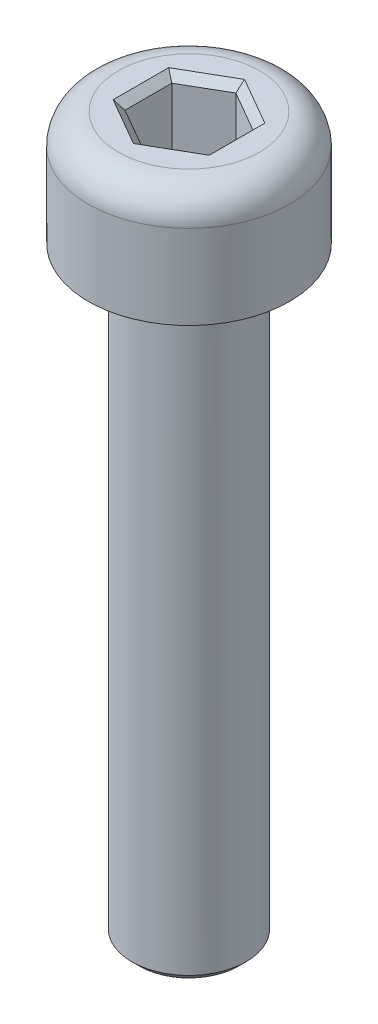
from build123d import *

# Parameters (mm, degrees)
CROQUIS1_R              = 3.35
SALIENTE_EXTRUIR1_DEPTH = 3.8
REDONDEO1_R             = 1
CROQUIS2_R              = 1.9
SALIENTE_EXTRUIR2_DEPTH = 20
CORTAR_EXTRUIR1_DEPTH   = 3
CHAFL_N1_SIZE           = 0.25
CHAFL_N2_SIZE           = 0.25


with BuildPart() as part:
    # Croquis1 → Saliente-Extruir1 (new body)
    with BuildSketch(Plane(origin=(0, 0, 0), x_dir=(1, 0, 0), z_dir=(0, 1, 0))):
        with Locations(Location((0, 0, 0), (0, 0, 90))):
            Circle(CROQUIS1_R)
    extrude(amount=SALIENTE_EXTRUIR1_DEPTH)

    # Redondeo1
    redondeo1_edges = [part.edges().sort_by_distance(p)[0] for p in [
        (0, 3.8, 3.35),
    ]]
    fillet(redondeo1_edges, radius=REDONDEO1_R)

    # Croquis2 → Saliente-Extruir2 (add)
    with BuildSketch(Plane.XZ):
        with Locations(Location((0, 0, 0), (0, 0, 90))):
            Circle(CROQUIS2_R)
    extrude(amount=SALIENTE_EXTRUIR2_DEPTH)

    # Croquis3 → Cortar-Extruir1 (cut)
    with BuildSketch(Plane(origin=(0, 3.8, 0), x_dir=(1, 0, 0), z_dir=(0, 1, 0))):
        Polygon((0, 1.558845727), (-1.35, 0.779422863), (-1.35, -0.779422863), (0, -1.558845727), (1.35, -0.779422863), (1.35, 0.779422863), align=None)
    extrude(amount=-CORTAR_EXTRUIR1_DEPTH, mode=Mode.SUBTRACT)

    # Chafl_n1
    chafl_n1_edges = [part.edges().sort_by_distance(p)[0] for p in [
        (0.675, 3.8, -1.169134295),
        (-0.675, 3.8, -1.169134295),
        (-1.35, 3.8, 0),
        (-0.675, 3.8, 1.169134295),
        (0.675, 3.8, 1.169134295),
        (1.35, 3.8, 0),
    ]]
    chamfer(chafl_n1_edges, length=CHAFL_N1_SIZE)

    # Chafl_n2
    chafl_n2_edges = [part.edges().sort_by_distance(p)[0] for p in [
        (0, -20, -1.9),
    ]]
    chamfer(chafl_n2_edges, length=CHAFL_N2_SIZE)


solid = part.part
